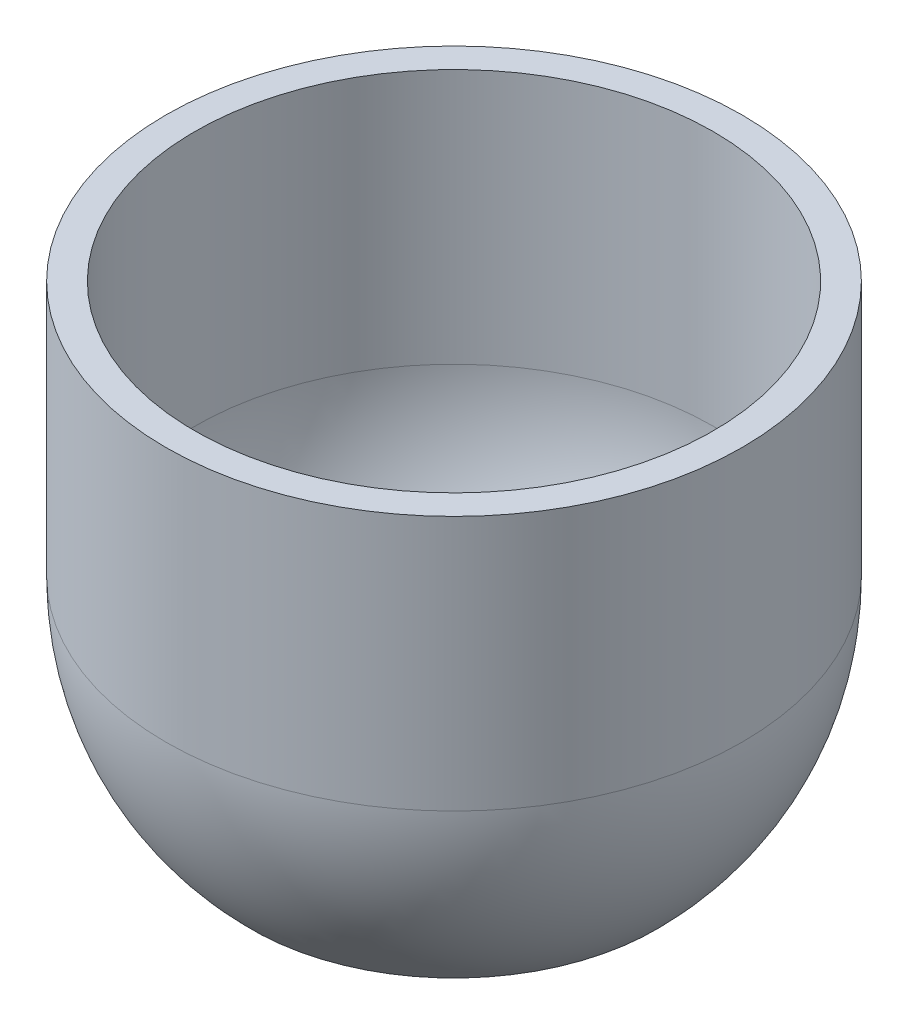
ISO-10303-21;
HEADER;
FILE_DESCRIPTION(('STEP AP214'),'2;1');
FILE_NAME('part.step','',(''),(''),'','','');
FILE_SCHEMA(('AUTOMOTIVE_DESIGN { 1 0 10303 214 1 1 1 1 }'));
ENDSEC;
DATA;
#1=APPLICATION_CONTEXT('core data for automotive mechanical design processes');
#2=APPLICATION_PROTOCOL_DEFINITION('international standard','automotive_design',2000,#1);
#3=PRODUCT_CONTEXT('',#1,'mechanical');
#4=PRODUCT('Part','Part','',(#3));
#5=PRODUCT_RELATED_PRODUCT_CATEGORY('part','',(#4));
#6=PRODUCT_DEFINITION_FORMATION('','',#4);
#7=PRODUCT_DEFINITION_CONTEXT('part definition',#1,'design');
#8=PRODUCT_DEFINITION('design','',#6,#7);
#9=PRODUCT_DEFINITION_SHAPE('','',#8);
#10=(LENGTH_UNIT() NAMED_UNIT(*) SI_UNIT(.MILLI.,.METRE.));
#11=(NAMED_UNIT(*) PLANE_ANGLE_UNIT() SI_UNIT($,.RADIAN.));
#12=(NAMED_UNIT(*) SI_UNIT($,.STERADIAN.) SOLID_ANGLE_UNIT());
#13=UNCERTAINTY_MEASURE_WITH_UNIT(LENGTH_MEASURE(1.E-05),#10,'distance_accuracy_value','');
#14=(GEOMETRIC_REPRESENTATION_CONTEXT(3) GLOBAL_UNCERTAINTY_ASSIGNED_CONTEXT((#13)) GLOBAL_UNIT_ASSIGNED_CONTEXT((#10,
#11,#12)) REPRESENTATION_CONTEXT('',''));
#15=CARTESIAN_POINT('',(0.,0.,0.));
#16=DIRECTION('',(0.,0.,1.));
#17=DIRECTION('',(1.,0.,0.));
#18=AXIS2_PLACEMENT_3D('',#15,#16,#17);
#19=CARTESIAN_POINT('',(0.,5.,0.));
#20=DIRECTION('',(0.,1.,0.));
#21=DIRECTION('',(0.,0.,1.));
#22=AXIS2_PLACEMENT_3D('',#19,#20,#21);
#23=PLANE('',#22);
#24=CARTESIAN_POINT('',(0.,5.,0.));
#25=DIRECTION('',(0.,-1.,0.));
#26=DIRECTION('',(0.,0.,-1.));
#27=AXIS2_PLACEMENT_3D('',#24,#25,#26);
#28=CIRCLE('',#27,32.8948540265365);
#29=CARTESIAN_POINT('',(0.,5.,-32.8948540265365));
#30=VERTEX_POINT('',#29);
#31=EDGE_CURVE('E10',#30,#30,#28,.T.);
#32=ORIENTED_EDGE('',*,*,#31,.F.);
#33=EDGE_LOOP('',(#32));
#34=FACE_BOUND('',#33,.T.);
#35=ADVANCED_FACE('F30',(#34),#23,.T.);
#36=CARTESIAN_POINT('',(0.,35.7071421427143,0.));
#37=DIRECTION('',(0.,-1.,0.));
#38=DIRECTION('',(1.,0.,0.));
#39=AXIS2_PLACEMENT_3D('',#36,#37,#38);
#40=SPHERICAL_SURFACE('',#39,45.);
#41=ORIENTED_EDGE('',*,*,#31,.T.);
#42=EDGE_LOOP('',(#41));
#43=FACE_BOUND('',#42,.T.);
#44=CARTESIAN_POINT('',(0.,35.7071421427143,0.));
#45=DIRECTION('',(0.,-1.,0.));
#46=DIRECTION('',(0.,0.,-1.));
#47=AXIS2_PLACEMENT_3D('',#44,#45,#46);
#48=CIRCLE('',#47,45.);
#49=CARTESIAN_POINT('',(0.,35.7071421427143,-45.));
#50=VERTEX_POINT('',#49);
#51=EDGE_CURVE('E36',#50,#50,#48,.T.);
#52=ORIENTED_EDGE('',*,*,#51,.F.);
#53=EDGE_LOOP('',(#52));
#54=FACE_BOUND('',#53,.T.);
#55=ADVANCED_FACE('F78',(#43,#54),#40,.F.);
#56=CARTESIAN_POINT('',(0.,0.,0.));
#57=DIRECTION('',(0.,-1.,0.));
#58=DIRECTION('',(0.,0.,-1.));
#59=AXIS2_PLACEMENT_3D('',#56,#57,#58);
#60=CYLINDRICAL_SURFACE('',#59,45.);
#61=ORIENTED_EDGE('',*,*,#51,.T.);
#62=EDGE_LOOP('',(#61));
#63=FACE_BOUND('',#62,.T.);
#64=CARTESIAN_POINT('',(0.,80.,0.));
#65=DIRECTION('',(0.,-1.,0.));
#66=DIRECTION('',(0.,0.,-1.));
#67=AXIS2_PLACEMENT_3D('',#64,#65,#66);
#68=CIRCLE('',#67,45.);
#69=CARTESIAN_POINT('',(0.,80.,-45.));
#70=VERTEX_POINT('',#69);
#71=EDGE_CURVE('E40',#70,#70,#68,.T.);
#72=ORIENTED_EDGE('',*,*,#71,.F.);
#73=EDGE_LOOP('',(#72));
#74=FACE_BOUND('',#73,.T.);
#75=ADVANCED_FACE('F73',(#63,#74),#60,.F.);
#76=CARTESIAN_POINT('',(45.,80.,0.));
#77=DIRECTION('',(0.,-1.,0.));
#78=DIRECTION('',(0.,0.,-1.));
#79=AXIS2_PLACEMENT_3D('',#76,#77,#78);
#80=PLANE('',#79);
#81=CARTESIAN_POINT('',(0.,80.,0.));
#82=DIRECTION('',(0.,-1.,0.));
#83=DIRECTION('',(0.,0.,-1.));
#84=AXIS2_PLACEMENT_3D('',#81,#82,#83);
#85=CIRCLE('',#84,50.);
#86=CARTESIAN_POINT('',(0.,80.,-50.));
#87=VERTEX_POINT('',#86);
#88=EDGE_CURVE('E44',#87,#87,#85,.T.);
#89=ORIENTED_EDGE('',*,*,#88,.F.);
#90=EDGE_LOOP('',(#89));
#91=FACE_BOUND('',#90,.T.);
#92=ORIENTED_EDGE('',*,*,#71,.T.);
#93=EDGE_LOOP('',(#92));
#94=FACE_BOUND('',#93,.T.);
#95=ADVANCED_FACE('F67',(#91,#94),#80,.F.);
#96=CARTESIAN_POINT('',(0.,0.,0.));
#97=DIRECTION('',(0.,-1.,0.));
#98=DIRECTION('',(0.,0.,-1.));
#99=AXIS2_PLACEMENT_3D('',#96,#97,#98);
#100=CYLINDRICAL_SURFACE('',#99,50.);
#101=CARTESIAN_POINT('',(0.,35.7071421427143,0.));
#102=DIRECTION('',(0.,-1.,0.));
#103=DIRECTION('',(0.,0.,-1.));
#104=AXIS2_PLACEMENT_3D('',#101,#102,#103);
#105=CIRCLE('',#104,50.);
#106=CARTESIAN_POINT('',(0.,35.7071421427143,-50.));
#107=VERTEX_POINT('',#106);
#108=EDGE_CURVE('E49',#107,#107,#105,.T.);
#109=ORIENTED_EDGE('',*,*,#108,.F.);
#110=EDGE_LOOP('',(#109));
#111=FACE_BOUND('',#110,.T.);
#112=ORIENTED_EDGE('',*,*,#88,.T.);
#113=EDGE_LOOP('',(#112));
#114=FACE_BOUND('',#113,.T.);
#115=ADVANCED_FACE('F61',(#111,#114),#100,.T.);
#116=CARTESIAN_POINT('',(0.,35.7071421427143,0.));
#117=DIRECTION('',(0.,-1.,0.));
#118=DIRECTION('',(1.,0.,0.));
#119=AXIS2_PLACEMENT_3D('',#116,#117,#118);
#120=SPHERICAL_SURFACE('',#119,50.);
#121=CARTESIAN_POINT('',(0.,0.,0.));
#122=DIRECTION('',(0.,-1.,0.));
#123=DIRECTION('',(0.,0.,-1.));
#124=AXIS2_PLACEMENT_3D('',#121,#122,#123);
#125=CIRCLE('',#124,35.);
#126=CARTESIAN_POINT('',(0.,0.,-35.));
#127=VERTEX_POINT('',#126);
#128=EDGE_CURVE('E52',#127,#127,#125,.T.);
#129=ORIENTED_EDGE('',*,*,#128,.F.);
#130=EDGE_LOOP('',(#129));
#131=FACE_BOUND('',#130,.T.);
#132=ORIENTED_EDGE('',*,*,#108,.T.);
#133=EDGE_LOOP('',(#132));
#134=FACE_BOUND('',#133,.T.);
#135=ADVANCED_FACE('F58',(#131,#134),#120,.T.);
#136=CARTESIAN_POINT('',(0.,0.,0.));
#137=DIRECTION('',(0.,1.,0.));
#138=DIRECTION('',(0.,0.,1.));
#139=AXIS2_PLACEMENT_3D('',#136,#137,#138);
#140=PLANE('',#139);
#141=ORIENTED_EDGE('',*,*,#128,.T.);
#142=EDGE_LOOP('',(#141));
#143=FACE_BOUND('',#142,.T.);
#144=ADVANCED_FACE('F56',(#143),#140,.F.);
#145=CLOSED_SHELL('',(#35,#55,#75,#95,#115,#135,#144));
#146=MANIFOLD_SOLID_BREP('B2',#145);
#147=ADVANCED_BREP_SHAPE_REPRESENTATION('',(#18,#146),#14);
#148=SHAPE_DEFINITION_REPRESENTATION(#9,#147);
ENDSEC;
END-ISO-10303-21;
